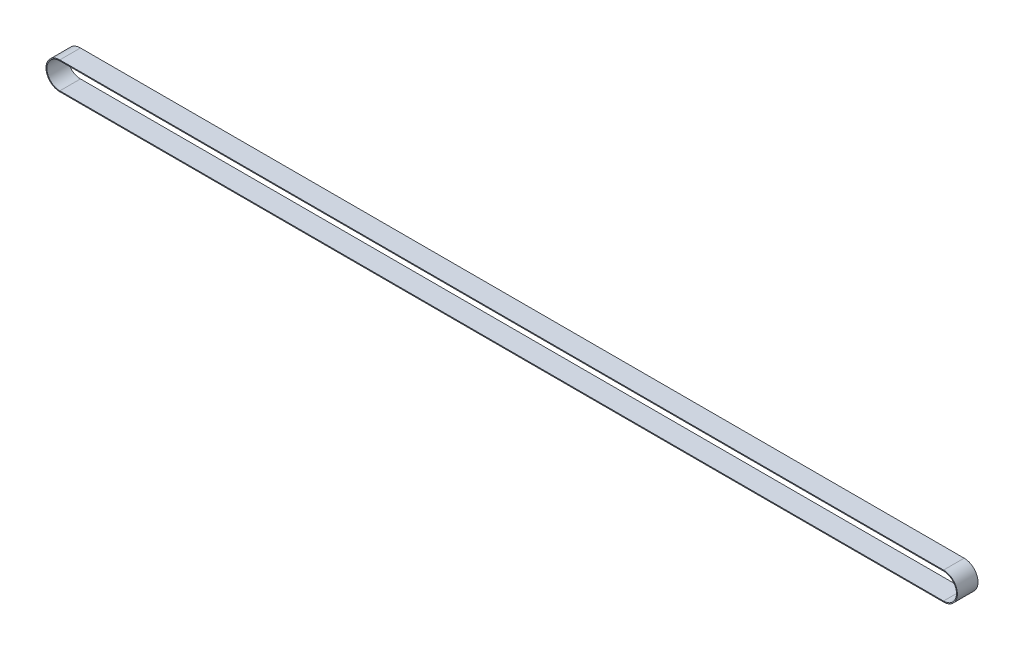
ISO-10303-21;
HEADER;
FILE_DESCRIPTION(('STEP AP214'),'2;1');
FILE_NAME('part.step','',(''),(''),'','','');
FILE_SCHEMA(('AUTOMOTIVE_DESIGN { 1 0 10303 214 1 1 1 1 }'));
ENDSEC;
DATA;
#1=APPLICATION_CONTEXT('core data for automotive mechanical design processes');
#2=APPLICATION_PROTOCOL_DEFINITION('international standard','automotive_design',2000,#1);
#3=PRODUCT_CONTEXT('',#1,'mechanical');
#4=PRODUCT('Part','Part','',(#3));
#5=PRODUCT_RELATED_PRODUCT_CATEGORY('part','',(#4));
#6=PRODUCT_DEFINITION_FORMATION('','',#4);
#7=PRODUCT_DEFINITION_CONTEXT('part definition',#1,'design');
#8=PRODUCT_DEFINITION('design','',#6,#7);
#9=PRODUCT_DEFINITION_SHAPE('','',#8);
#10=(LENGTH_UNIT() NAMED_UNIT(*) SI_UNIT(.MILLI.,.METRE.));
#11=(NAMED_UNIT(*) PLANE_ANGLE_UNIT() SI_UNIT($,.RADIAN.));
#12=(NAMED_UNIT(*) SI_UNIT($,.STERADIAN.) SOLID_ANGLE_UNIT());
#13=UNCERTAINTY_MEASURE_WITH_UNIT(LENGTH_MEASURE(1.E-05),#10,'distance_accuracy_value','');
#14=(GEOMETRIC_REPRESENTATION_CONTEXT(3) GLOBAL_UNCERTAINTY_ASSIGNED_CONTEXT((#13)) GLOBAL_UNIT_ASSIGNED_CONTEXT((#10,
#11,#12)) REPRESENTATION_CONTEXT('',''));
#15=CARTESIAN_POINT('',(0.,0.,0.));
#16=DIRECTION('',(0.,0.,1.));
#17=DIRECTION('',(1.,0.,0.));
#18=AXIS2_PLACEMENT_3D('',#15,#16,#17);
#19=CARTESIAN_POINT('',(1522.,147.999999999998,17.5));
#20=DIRECTION('',(0.,0.,-1.));
#21=DIRECTION('',(-1.,0.,0.));
#22=AXIS2_PLACEMENT_3D('',#19,#20,#21);
#23=PLANE('',#22);
#24=CARTESIAN_POINT('',(1522.,147.999999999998,17.5));
#25=DIRECTION('',(0.,0.,-1.));
#26=DIRECTION('',(-1.,0.,0.));
#27=AXIS2_PLACEMENT_3D('',#24,#25,#26);
#28=CIRCLE('',#27,23.5);
#29=CARTESIAN_POINT('',(1522.,124.499999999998,17.5));
#30=VERTEX_POINT('',#29);
#31=CARTESIAN_POINT('',(1522.,171.499999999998,17.5));
#32=VERTEX_POINT('',#31);
#33=EDGE_CURVE('E174',#30,#32,#28,.F.);
#34=ORIENTED_EDGE('',*,*,#33,.T.);
#35=DIRECTION('',(-1.,0.,0.));
#36=VECTOR('',#35,1.);
#37=CARTESIAN_POINT('',(1522.,171.499999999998,17.5));
#38=LINE('',#37,#36);
#39=CARTESIAN_POINT('',(21.9999999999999,171.5,17.5));
#40=VERTEX_POINT('',#39);
#41=EDGE_CURVE('E177',#32,#40,#38,.T.);
#42=ORIENTED_EDGE('',*,*,#41,.T.);
#43=CARTESIAN_POINT('',(21.9999999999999,148.,17.5));
#44=DIRECTION('',(0.,0.,-1.));
#45=DIRECTION('',(-1.,0.,0.));
#46=AXIS2_PLACEMENT_3D('',#43,#44,#45);
#47=CIRCLE('',#46,23.5);
#48=CARTESIAN_POINT('',(21.9999999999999,124.5,17.5));
#49=VERTEX_POINT('',#48);
#50=EDGE_CURVE('E180',#40,#49,#47,.F.);
#51=ORIENTED_EDGE('',*,*,#50,.T.);
#52=DIRECTION('',(1.,0.,0.));
#53=VECTOR('',#52,1.);
#54=CARTESIAN_POINT('',(1522.,124.499999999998,17.5));
#55=LINE('',#54,#53);
#56=EDGE_CURVE('E182',#49,#30,#55,.T.);
#57=ORIENTED_EDGE('',*,*,#56,.T.);
#58=EDGE_LOOP('',(#34,#42,#51,#57));
#59=FACE_BOUND('',#58,.T.);
#60=CARTESIAN_POINT('',(1522.,147.999999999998,17.5));
#61=DIRECTION('',(0.,0.,1.));
#62=DIRECTION('',(-1.,0.,0.));
#63=AXIS2_PLACEMENT_3D('',#60,#61,#62);
#64=CIRCLE('',#63,22.);
#65=CARTESIAN_POINT('',(1522.,125.999999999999,17.5));
#66=VERTEX_POINT('',#65);
#67=CARTESIAN_POINT('',(1522.,169.999999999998,17.5));
#68=VERTEX_POINT('',#67);
#69=EDGE_CURVE('E132',#66,#68,#64,.T.);
#70=ORIENTED_EDGE('',*,*,#69,.F.);
#71=DIRECTION('',(1.,0.,0.));
#72=VECTOR('',#71,1.);
#73=CARTESIAN_POINT('',(1522.,125.999999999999,17.5));
#74=LINE('',#73,#72);
#75=CARTESIAN_POINT('',(21.9999999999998,126.,17.5));
#76=VERTEX_POINT('',#75);
#77=EDGE_CURVE('E157',#76,#66,#74,.T.);
#78=ORIENTED_EDGE('',*,*,#77,.F.);
#79=CARTESIAN_POINT('',(21.9999999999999,148.,17.5));
#80=DIRECTION('',(0.,0.,1.));
#81=DIRECTION('',(-1.,0.,0.));
#82=AXIS2_PLACEMENT_3D('',#79,#80,#81);
#83=CIRCLE('',#82,22.);
#84=CARTESIAN_POINT('',(21.9999999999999,170.,17.5));
#85=VERTEX_POINT('',#84);
#86=EDGE_CURVE('E152',#85,#76,#83,.T.);
#87=ORIENTED_EDGE('',*,*,#86,.F.);
#88=DIRECTION('',(-1.,0.,0.));
#89=VECTOR('',#88,1.);
#90=CARTESIAN_POINT('',(21.9999999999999,170.,17.5));
#91=LINE('',#90,#89);
#92=EDGE_CURVE('E140',#68,#85,#91,.T.);
#93=ORIENTED_EDGE('',*,*,#92,.F.);
#94=EDGE_LOOP('',(#70,#78,#87,#93));
#95=FACE_BOUND('',#94,.T.);
#96=ADVANCED_FACE('F67',(#59,#95),#23,.F.);
#97=CARTESIAN_POINT('',(1522.,147.999999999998,-17.5));
#98=DIRECTION('',(0.,0.,-1.));
#99=DIRECTION('',(-1.,0.,0.));
#100=AXIS2_PLACEMENT_3D('',#97,#98,#99);
#101=PLANE('',#100);
#102=CARTESIAN_POINT('',(1522.,147.999999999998,-17.5));
#103=DIRECTION('',(0.,0.,-1.));
#104=DIRECTION('',(-1.,0.,0.));
#105=AXIS2_PLACEMENT_3D('',#102,#103,#104);
#106=CIRCLE('',#105,23.5);
#107=CARTESIAN_POINT('',(1522.,124.499999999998,-17.5));
#108=VERTEX_POINT('',#107);
#109=CARTESIAN_POINT('',(1522.,171.499999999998,-17.5));
#110=VERTEX_POINT('',#109);
#111=EDGE_CURVE('E148',#108,#110,#106,.F.);
#112=ORIENTED_EDGE('',*,*,#111,.F.);
#113=DIRECTION('',(1.,0.,0.));
#114=VECTOR('',#113,1.);
#115=CARTESIAN_POINT('',(1522.,124.499999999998,-17.5));
#116=LINE('',#115,#114);
#117=CARTESIAN_POINT('',(21.9999999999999,124.5,-17.5));
#118=VERTEX_POINT('',#117);
#119=EDGE_CURVE('E178',#118,#108,#116,.T.);
#120=ORIENTED_EDGE('',*,*,#119,.F.);
#121=CARTESIAN_POINT('',(21.9999999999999,148.,-17.5));
#122=DIRECTION('',(0.,0.,-1.));
#123=DIRECTION('',(-1.,0.,0.));
#124=AXIS2_PLACEMENT_3D('',#121,#122,#123);
#125=CIRCLE('',#124,23.5);
#126=CARTESIAN_POINT('',(21.9999999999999,171.5,-17.5));
#127=VERTEX_POINT('',#126);
#128=EDGE_CURVE('E190',#127,#118,#125,.F.);
#129=ORIENTED_EDGE('',*,*,#128,.F.);
#130=DIRECTION('',(-1.,0.,0.));
#131=VECTOR('',#130,1.);
#132=CARTESIAN_POINT('',(1522.,171.499999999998,-17.5));
#133=LINE('',#132,#131);
#134=EDGE_CURVE('E188',#110,#127,#133,.T.);
#135=ORIENTED_EDGE('',*,*,#134,.F.);
#136=EDGE_LOOP('',(#112,#120,#129,#135));
#137=FACE_BOUND('',#136,.T.);
#138=DIRECTION('',(1.,0.,0.));
#139=VECTOR('',#138,1.);
#140=CARTESIAN_POINT('',(1522.,125.999999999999,-17.5));
#141=LINE('',#140,#139);
#142=CARTESIAN_POINT('',(21.9999999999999,126.,-17.5));
#143=VERTEX_POINT('',#142);
#144=CARTESIAN_POINT('',(1522.,125.999999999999,-17.5));
#145=VERTEX_POINT('',#144);
#146=EDGE_CURVE('E141',#143,#145,#141,.T.);
#147=ORIENTED_EDGE('',*,*,#146,.T.);
#148=CARTESIAN_POINT('',(1522.,147.999999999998,-17.5));
#149=DIRECTION('',(0.,0.,1.));
#150=DIRECTION('',(-1.,0.,0.));
#151=AXIS2_PLACEMENT_3D('',#148,#149,#150);
#152=CIRCLE('',#151,22.);
#153=CARTESIAN_POINT('',(1522.,169.999999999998,-17.5));
#154=VERTEX_POINT('',#153);
#155=EDGE_CURVE('E90',#145,#154,#152,.T.);
#156=ORIENTED_EDGE('',*,*,#155,.T.);
#157=DIRECTION('',(-1.,0.,0.));
#158=VECTOR('',#157,1.);
#159=CARTESIAN_POINT('',(21.9999999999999,170.,-17.5));
#160=LINE('',#159,#158);
#161=CARTESIAN_POINT('',(21.9999999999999,170.,-17.5));
#162=VERTEX_POINT('',#161);
#163=EDGE_CURVE('E147',#154,#162,#160,.T.);
#164=ORIENTED_EDGE('',*,*,#163,.T.);
#165=CARTESIAN_POINT('',(21.9999999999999,148.,-17.5));
#166=DIRECTION('',(0.,0.,1.));
#167=DIRECTION('',(-1.,0.,0.));
#168=AXIS2_PLACEMENT_3D('',#165,#166,#167);
#169=CIRCLE('',#168,22.);
#170=EDGE_CURVE('E165',#162,#143,#169,.T.);
#171=ORIENTED_EDGE('',*,*,#170,.T.);
#172=EDGE_LOOP('',(#147,#156,#164,#171));
#173=FACE_BOUND('',#172,.T.);
#174=ADVANCED_FACE('F209',(#137,#173),#101,.T.);
#175=CARTESIAN_POINT('',(1522.,147.999999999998,17.5));
#176=DIRECTION('',(0.,0.,-1.));
#177=DIRECTION('',(-1.,0.,0.));
#178=AXIS2_PLACEMENT_3D('',#175,#176,#177);
#179=CYLINDRICAL_SURFACE('',#178,23.5);
#180=ORIENTED_EDGE('',*,*,#111,.T.);
#181=DIRECTION('',(0.,0.,-1.));
#182=VECTOR('',#181,1.);
#183=CARTESIAN_POINT('',(1522.,171.499999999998,17.5));
#184=LINE('',#183,#182);
#185=EDGE_CURVE('E12',#32,#110,#184,.T.);
#186=ORIENTED_EDGE('',*,*,#185,.F.);
#187=ORIENTED_EDGE('',*,*,#33,.F.);
#188=DIRECTION('',(0.,0.,-1.));
#189=VECTOR('',#188,1.);
#190=CARTESIAN_POINT('',(1522.,124.499999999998,17.5));
#191=LINE('',#190,#189);
#192=EDGE_CURVE('E185',#30,#108,#191,.T.);
#193=ORIENTED_EDGE('',*,*,#192,.T.);
#194=EDGE_LOOP('',(#180,#186,#187,#193));
#195=FACE_BOUND('',#194,.T.);
#196=ADVANCED_FACE('F69',(#195),#179,.T.);
#197=CARTESIAN_POINT('',(1522.,171.499999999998,17.5));
#198=DIRECTION('',(0.,-1.,0.));
#199=DIRECTION('',(1.,0.,0.));
#200=AXIS2_PLACEMENT_3D('',#197,#198,#199);
#201=PLANE('',#200);
#202=ORIENTED_EDGE('',*,*,#134,.T.);
#203=DIRECTION('',(0.,0.,-1.));
#204=VECTOR('',#203,1.);
#205=CARTESIAN_POINT('',(21.9999999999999,171.5,17.5));
#206=LINE('',#205,#204);
#207=EDGE_CURVE('E75',#40,#127,#206,.T.);
#208=ORIENTED_EDGE('',*,*,#207,.F.);
#209=ORIENTED_EDGE('',*,*,#41,.F.);
#210=ORIENTED_EDGE('',*,*,#185,.T.);
#211=EDGE_LOOP('',(#202,#208,#209,#210));
#212=FACE_BOUND('',#211,.T.);
#213=ADVANCED_FACE('F219',(#212),#201,.F.);
#214=CARTESIAN_POINT('',(21.9999999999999,148.,17.5));
#215=DIRECTION('',(0.,0.,-1.));
#216=DIRECTION('',(-1.,0.,0.));
#217=AXIS2_PLACEMENT_3D('',#214,#215,#216);
#218=CYLINDRICAL_SURFACE('',#217,23.5);
#219=ORIENTED_EDGE('',*,*,#128,.T.);
#220=DIRECTION('',(0.,0.,-1.));
#221=VECTOR('',#220,1.);
#222=CARTESIAN_POINT('',(21.9999999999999,124.5,17.5));
#223=LINE('',#222,#221);
#224=EDGE_CURVE('E196',#49,#118,#223,.T.);
#225=ORIENTED_EDGE('',*,*,#224,.F.);
#226=ORIENTED_EDGE('',*,*,#50,.F.);
#227=ORIENTED_EDGE('',*,*,#207,.T.);
#228=EDGE_LOOP('',(#219,#225,#226,#227));
#229=FACE_BOUND('',#228,.T.);
#230=ADVANCED_FACE('F203',(#229),#218,.T.);
#231=CARTESIAN_POINT('',(1522.,124.499999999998,17.5));
#232=DIRECTION('',(0.,1.,0.));
#233=DIRECTION('',(-1.,0.,0.));
#234=AXIS2_PLACEMENT_3D('',#231,#232,#233);
#235=PLANE('',#234);
#236=ORIENTED_EDGE('',*,*,#119,.T.);
#237=ORIENTED_EDGE('',*,*,#192,.F.);
#238=ORIENTED_EDGE('',*,*,#56,.F.);
#239=ORIENTED_EDGE('',*,*,#224,.T.);
#240=EDGE_LOOP('',(#236,#237,#238,#239));
#241=FACE_BOUND('',#240,.T.);
#242=ADVANCED_FACE('F213',(#241),#235,.F.);
#243=CARTESIAN_POINT('',(1522.,147.999999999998,17.5));
#244=DIRECTION('',(0.,0.,-1.));
#245=DIRECTION('',(-1.,0.,0.));
#246=AXIS2_PLACEMENT_3D('',#243,#244,#245);
#247=CYLINDRICAL_SURFACE('',#246,22.);
#248=ORIENTED_EDGE('',*,*,#155,.F.);
#249=DIRECTION('',(0.,0.,-1.));
#250=VECTOR('',#249,1.);
#251=CARTESIAN_POINT('',(1522.,125.999999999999,17.5));
#252=LINE('',#251,#250);
#253=EDGE_CURVE('E136',#66,#145,#252,.T.);
#254=ORIENTED_EDGE('',*,*,#253,.F.);
#255=ORIENTED_EDGE('',*,*,#69,.T.);
#256=DIRECTION('',(0.,0.,-1.));
#257=VECTOR('',#256,1.);
#258=CARTESIAN_POINT('',(1522.,169.999999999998,17.5));
#259=LINE('',#258,#257);
#260=EDGE_CURVE('E135',#68,#154,#259,.T.);
#261=ORIENTED_EDGE('',*,*,#260,.T.);
#262=EDGE_LOOP('',(#248,#254,#255,#261));
#263=FACE_BOUND('',#262,.T.);
#264=ADVANCED_FACE('F134',(#263),#247,.F.);
#265=CARTESIAN_POINT('',(21.9999999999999,170.,17.5));
#266=DIRECTION('',(0.,-1.,0.));
#267=DIRECTION('',(1.,0.,0.));
#268=AXIS2_PLACEMENT_3D('',#265,#266,#267);
#269=PLANE('',#268);
#270=ORIENTED_EDGE('',*,*,#163,.F.);
#271=ORIENTED_EDGE('',*,*,#260,.F.);
#272=ORIENTED_EDGE('',*,*,#92,.T.);
#273=DIRECTION('',(0.,0.,-1.));
#274=VECTOR('',#273,1.);
#275=CARTESIAN_POINT('',(21.9999999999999,170.,17.5));
#276=LINE('',#275,#274);
#277=EDGE_CURVE('E149',#85,#162,#276,.T.);
#278=ORIENTED_EDGE('',*,*,#277,.T.);
#279=EDGE_LOOP('',(#270,#271,#272,#278));
#280=FACE_BOUND('',#279,.T.);
#281=ADVANCED_FACE('F144',(#280),#269,.T.);
#282=CARTESIAN_POINT('',(21.9999999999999,148.,17.5));
#283=DIRECTION('',(0.,0.,-1.));
#284=DIRECTION('',(-1.,0.,0.));
#285=AXIS2_PLACEMENT_3D('',#282,#283,#284);
#286=CYLINDRICAL_SURFACE('',#285,22.);
#287=ORIENTED_EDGE('',*,*,#170,.F.);
#288=ORIENTED_EDGE('',*,*,#277,.F.);
#289=ORIENTED_EDGE('',*,*,#86,.T.);
#290=DIRECTION('',(0.,0.,-1.));
#291=VECTOR('',#290,1.);
#292=CARTESIAN_POINT('',(21.9999999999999,126.,17.5));
#293=LINE('',#292,#291);
#294=EDGE_CURVE('E82',#76,#143,#293,.T.);
#295=ORIENTED_EDGE('',*,*,#294,.T.);
#296=EDGE_LOOP('',(#287,#288,#289,#295));
#297=FACE_BOUND('',#296,.T.);
#298=ADVANCED_FACE('F242',(#297),#286,.F.);
#299=CARTESIAN_POINT('',(1522.,125.999999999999,17.5));
#300=DIRECTION('',(0.,1.,0.));
#301=DIRECTION('',(-1.,0.,0.));
#302=AXIS2_PLACEMENT_3D('',#299,#300,#301);
#303=PLANE('',#302);
#304=ORIENTED_EDGE('',*,*,#146,.F.);
#305=ORIENTED_EDGE('',*,*,#294,.F.);
#306=ORIENTED_EDGE('',*,*,#77,.T.);
#307=ORIENTED_EDGE('',*,*,#253,.T.);
#308=EDGE_LOOP('',(#304,#305,#306,#307));
#309=FACE_BOUND('',#308,.T.);
#310=ADVANCED_FACE('F246',(#309),#303,.T.);
#311=CLOSED_SHELL('',(#96,#174,#196,#213,#230,#242,#264,#281,#298,#310));
#312=MANIFOLD_SOLID_BREP('B2',#311);
#313=ADVANCED_BREP_SHAPE_REPRESENTATION('',(#18,#312),#14);
#314=SHAPE_DEFINITION_REPRESENTATION(#9,#313);
ENDSEC;
END-ISO-10303-21;
